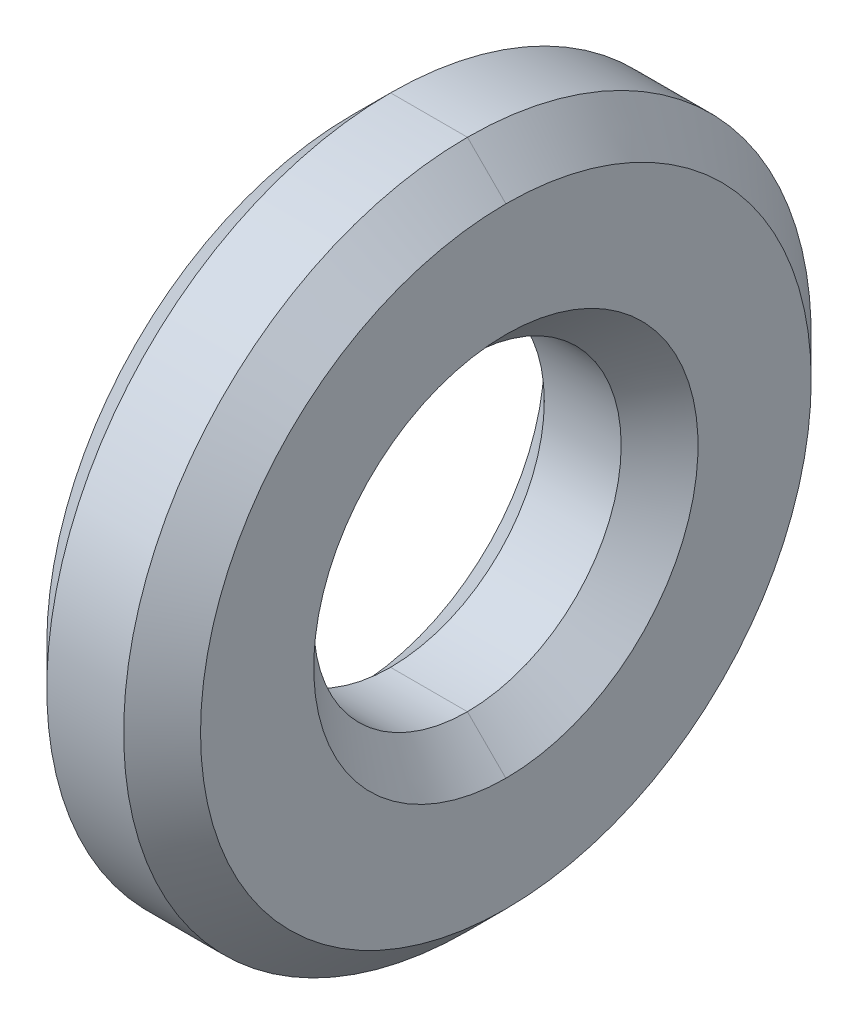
ISO-10303-21;
HEADER;
FILE_DESCRIPTION(('STEP AP214'),'2;1');
FILE_NAME('part.step','',(''),(''),'','','');
FILE_SCHEMA(('AUTOMOTIVE_DESIGN { 1 0 10303 214 1 1 1 1 }'));
ENDSEC;
DATA;
#1=APPLICATION_CONTEXT('core data for automotive mechanical design processes');
#2=APPLICATION_PROTOCOL_DEFINITION('international standard','automotive_design',2000,#1);
#3=PRODUCT_CONTEXT('',#1,'mechanical');
#4=PRODUCT('Part','Part','',(#3));
#5=PRODUCT_RELATED_PRODUCT_CATEGORY('part','',(#4));
#6=PRODUCT_DEFINITION_FORMATION('','',#4);
#7=PRODUCT_DEFINITION_CONTEXT('part definition',#1,'design');
#8=PRODUCT_DEFINITION('design','',#6,#7);
#9=PRODUCT_DEFINITION_SHAPE('','',#8);
#10=(LENGTH_UNIT() NAMED_UNIT(*) SI_UNIT(.MILLI.,.METRE.));
#11=(NAMED_UNIT(*) PLANE_ANGLE_UNIT() SI_UNIT($,.RADIAN.));
#12=(NAMED_UNIT(*) SI_UNIT($,.STERADIAN.) SOLID_ANGLE_UNIT());
#13=UNCERTAINTY_MEASURE_WITH_UNIT(LENGTH_MEASURE(1.E-05),#10,'distance_accuracy_value','');
#14=(GEOMETRIC_REPRESENTATION_CONTEXT(3) GLOBAL_UNCERTAINTY_ASSIGNED_CONTEXT((#13)) GLOBAL_UNIT_ASSIGNED_CONTEXT((#10,
#11,#12)) REPRESENTATION_CONTEXT('',''));
#15=CARTESIAN_POINT('',(0.,0.,0.));
#16=DIRECTION('',(0.,0.,1.));
#17=DIRECTION('',(1.,0.,0.));
#18=AXIS2_PLACEMENT_3D('',#15,#16,#17);
#19=CARTESIAN_POINT('',(2.9860679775,0.,0.));
#20=DIRECTION('',(-1.,0.,0.));
#21=DIRECTION('',(0.,-0.50000000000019,-0.866025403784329));
#22=AXIS2_PLACEMENT_3D('',#19,#20,#21);
#23=CONICAL_SURFACE('',#22,0.999999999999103,0.785398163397);
#24=DIRECTION('',(0.707106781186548,0.707106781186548,0.));
#25=VECTOR('',#24,1.);
#26=CARTESIAN_POINT('',(1.875,-2.1110679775,0.));
#27=LINE('',#26,#25);
#28=CARTESIAN_POINT('',(1.75,-2.2360679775,0.));
#29=VERTEX_POINT('',#28);
#30=CARTESIAN_POINT('',(2.,-1.9860679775,0.));
#31=VERTEX_POINT('',#30);
#32=EDGE_CURVE('E11',#29,#31,#27,.T.);
#33=ORIENTED_EDGE('',*,*,#32,.T.);
#34=CARTESIAN_POINT('',(2.,0.,0.));
#35=DIRECTION('',(-1.,0.,0.));
#36=DIRECTION('',(0.,-1.,0.));
#37=AXIS2_PLACEMENT_3D('',#34,#35,#36);
#38=CIRCLE('',#37,1.9860679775);
#39=CARTESIAN_POINT('',(2.,1.9860679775,0.));
#40=VERTEX_POINT('',#39);
#41=EDGE_CURVE('E154',#31,#40,#38,.T.);
#42=ORIENTED_EDGE('',*,*,#41,.T.);
#43=DIRECTION('',(0.707106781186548,-0.707106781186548,0.));
#44=VECTOR('',#43,1.);
#45=CARTESIAN_POINT('',(1.875,2.1110679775,0.));
#46=LINE('',#45,#44);
#47=CARTESIAN_POINT('',(1.75,2.2360679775,0.));
#48=VERTEX_POINT('',#47);
#49=EDGE_CURVE('E27',#48,#40,#46,.T.);
#50=ORIENTED_EDGE('',*,*,#49,.F.);
#51=CARTESIAN_POINT('',(1.75,0.,0.));
#52=DIRECTION('',(-1.,0.,0.));
#53=DIRECTION('',(0.,1.,0.));
#54=AXIS2_PLACEMENT_3D('',#51,#52,#53);
#55=CIRCLE('',#54,2.2360679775);
#56=EDGE_CURVE('E176',#29,#48,#55,.T.);
#57=ORIENTED_EDGE('',*,*,#56,.F.);
#58=EDGE_LOOP('',(#33,#42,#50,#57));
#59=FACE_BOUND('',#58,.T.);
#60=ADVANCED_FACE('F16',(#59),#23,.T.);
#61=CARTESIAN_POINT('',(2.9860679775,0.,0.));
#62=DIRECTION('',(-1.,0.,0.));
#63=DIRECTION('',(0.,1.,0.));
#64=AXIS2_PLACEMENT_3D('',#61,#62,#63);
#65=CONICAL_SURFACE('',#64,0.999999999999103,0.785398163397);
#66=ORIENTED_EDGE('',*,*,#49,.T.);
#67=CARTESIAN_POINT('',(2.,0.,0.));
#68=DIRECTION('',(-1.,0.,0.));
#69=DIRECTION('',(0.,-1.,0.));
#70=AXIS2_PLACEMENT_3D('',#67,#68,#69);
#71=CIRCLE('',#70,1.9860679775);
#72=EDGE_CURVE('E157',#40,#31,#71,.T.);
#73=ORIENTED_EDGE('',*,*,#72,.T.);
#74=ORIENTED_EDGE('',*,*,#32,.F.);
#75=CARTESIAN_POINT('',(1.75,0.,0.));
#76=DIRECTION('',(-1.,0.,0.));
#77=DIRECTION('',(0.,1.,0.));
#78=AXIS2_PLACEMENT_3D('',#75,#76,#77);
#79=CIRCLE('',#78,2.2360679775);
#80=EDGE_CURVE('E179',#48,#29,#79,.T.);
#81=ORIENTED_EDGE('',*,*,#80,.F.);
#82=EDGE_LOOP('',(#66,#73,#74,#81));
#83=FACE_BOUND('',#82,.T.);
#84=ADVANCED_FACE('F231',(#83),#65,.T.);
#85=CARTESIAN_POINT('',(2.11000000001,0.,0.));
#86=DIRECTION('',(1.,0.,0.));
#87=DIRECTION('',(0.,1.,0.));
#88=AXIS2_PLACEMENT_3D('',#85,#86,#87);
#89=CYLINDRICAL_SURFACE('',#88,2.2360679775);
#90=DIRECTION('',(1.,0.,0.));
#91=VECTOR('',#90,1.);
#92=CARTESIAN_POINT('',(2.11000000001,2.2360679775,0.));
#93=LINE('',#92,#91);
#94=CARTESIAN_POINT('',(1.25,2.2360679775,0.));
#95=VERTEX_POINT('',#94);
#96=EDGE_CURVE('E117',#95,#48,#93,.T.);
#97=ORIENTED_EDGE('',*,*,#96,.F.);
#98=CARTESIAN_POINT('',(1.25,0.,0.));
#99=DIRECTION('',(1.,0.,0.));
#100=DIRECTION('',(0.,1.,0.));
#101=AXIS2_PLACEMENT_3D('',#98,#99,#100);
#102=CIRCLE('',#101,2.2360679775);
#103=CARTESIAN_POINT('',(1.25,-2.2360679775,0.));
#104=VERTEX_POINT('',#103);
#105=EDGE_CURVE('E158',#95,#104,#102,.T.);
#106=ORIENTED_EDGE('',*,*,#105,.T.);
#107=DIRECTION('',(1.,0.,0.));
#108=VECTOR('',#107,1.);
#109=CARTESIAN_POINT('',(2.11000000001,-2.2360679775,0.));
#110=LINE('',#109,#108);
#111=EDGE_CURVE('E165',#104,#29,#110,.T.);
#112=ORIENTED_EDGE('',*,*,#111,.T.);
#113=ORIENTED_EDGE('',*,*,#56,.T.);
#114=EDGE_LOOP('',(#97,#106,#112,#113));
#115=FACE_BOUND('',#114,.T.);
#116=ADVANCED_FACE('F18',(#115),#89,.T.);
#117=CARTESIAN_POINT('',(2.11000000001,0.,0.));
#118=DIRECTION('',(1.,0.,0.));
#119=DIRECTION('',(0.,1.,0.));
#120=AXIS2_PLACEMENT_3D('',#117,#118,#119);
#121=CYLINDRICAL_SURFACE('',#120,2.2360679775);
#122=ORIENTED_EDGE('',*,*,#111,.F.);
#123=CARTESIAN_POINT('',(1.25,0.,0.));
#124=DIRECTION('',(1.,0.,0.));
#125=DIRECTION('',(0.,1.,0.));
#126=AXIS2_PLACEMENT_3D('',#123,#124,#125);
#127=CIRCLE('',#126,2.2360679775);
#128=EDGE_CURVE('E163',#104,#95,#127,.T.);
#129=ORIENTED_EDGE('',*,*,#128,.T.);
#130=ORIENTED_EDGE('',*,*,#96,.T.);
#131=ORIENTED_EDGE('',*,*,#80,.T.);
#132=EDGE_LOOP('',(#122,#129,#130,#131));
#133=FACE_BOUND('',#132,.T.);
#134=ADVANCED_FACE('F254',(#133),#121,.T.);
#135=CARTESIAN_POINT('',(2.,-10.,-11.5));
#136=DIRECTION('',(-1.,0.,0.));
#137=DIRECTION('',(0.,1.,0.));
#138=AXIS2_PLACEMENT_3D('',#135,#136,#137);
#139=PLANE('',#138);
#140=CARTESIAN_POINT('',(2.,0.,0.));
#141=DIRECTION('',(-1.,0.,0.));
#142=DIRECTION('',(0.,-1.,0.));
#143=AXIS2_PLACEMENT_3D('',#140,#141,#142);
#144=CIRCLE('',#143,1.25);
#145=CARTESIAN_POINT('',(2.,-1.25,0.));
#146=VERTEX_POINT('',#145);
#147=CARTESIAN_POINT('',(2.,1.25,0.));
#148=VERTEX_POINT('',#147);
#149=EDGE_CURVE('E87',#146,#148,#144,.T.);
#150=ORIENTED_EDGE('',*,*,#149,.T.);
#151=CARTESIAN_POINT('',(2.,0.,0.));
#152=DIRECTION('',(-1.,0.,0.));
#153=DIRECTION('',(0.,-1.,0.));
#154=AXIS2_PLACEMENT_3D('',#151,#152,#153);
#155=CIRCLE('',#154,1.25);
#156=EDGE_CURVE('E83',#148,#146,#155,.T.);
#157=ORIENTED_EDGE('',*,*,#156,.T.);
#158=EDGE_LOOP('',(#150,#157));
#159=FACE_BOUND('',#158,.T.);
#160=ORIENTED_EDGE('',*,*,#41,.F.);
#161=ORIENTED_EDGE('',*,*,#72,.F.);
#162=EDGE_LOOP('',(#160,#161));
#163=FACE_BOUND('',#162,.T.);
#164=ADVANCED_FACE('F85',(#159,#163),#139,.F.);
#165=CARTESIAN_POINT('',(0.0139320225,0.,0.));
#166=DIRECTION('',(1.,0.,0.));
#167=DIRECTION('',(0.,1.,0.));
#168=AXIS2_PLACEMENT_3D('',#165,#166,#167);
#169=CONICAL_SURFACE('',#168,0.999999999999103,0.785398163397);
#170=DIRECTION('',(-0.707106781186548,-0.707106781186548,0.));
#171=VECTOR('',#170,1.);
#172=CARTESIAN_POINT('',(1.125,2.1110679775,0.));
#173=LINE('',#172,#171);
#174=CARTESIAN_POINT('',(1.,1.9860679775,0.));
#175=VERTEX_POINT('',#174);
#176=EDGE_CURVE('E122',#95,#175,#173,.T.);
#177=ORIENTED_EDGE('',*,*,#176,.T.);
#178=CARTESIAN_POINT('',(1.,0.,0.));
#179=DIRECTION('',(1.,0.,0.));
#180=DIRECTION('',(0.,1.,0.));
#181=AXIS2_PLACEMENT_3D('',#178,#179,#180);
#182=CIRCLE('',#181,1.9860679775);
#183=CARTESIAN_POINT('',(1.,-1.9860679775,0.));
#184=VERTEX_POINT('',#183);
#185=EDGE_CURVE('E92',#175,#184,#182,.T.);
#186=ORIENTED_EDGE('',*,*,#185,.T.);
#187=DIRECTION('',(-0.707106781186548,0.707106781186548,0.));
#188=VECTOR('',#187,1.);
#189=CARTESIAN_POINT('',(1.125,-2.1110679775,0.));
#190=LINE('',#189,#188);
#191=EDGE_CURVE('E119',#104,#184,#190,.T.);
#192=ORIENTED_EDGE('',*,*,#191,.F.);
#193=ORIENTED_EDGE('',*,*,#105,.F.);
#194=EDGE_LOOP('',(#177,#186,#192,#193));
#195=FACE_BOUND('',#194,.T.);
#196=ADVANCED_FACE('F213',(#195),#169,.T.);
#197=CARTESIAN_POINT('',(0.0139320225,0.,0.));
#198=DIRECTION('',(1.,0.,0.));
#199=DIRECTION('',(0.,-0.50000000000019,0.866025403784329));
#200=AXIS2_PLACEMENT_3D('',#197,#198,#199);
#201=CONICAL_SURFACE('',#200,0.999999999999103,0.785398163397);
#202=ORIENTED_EDGE('',*,*,#191,.T.);
#203=CARTESIAN_POINT('',(1.,0.,0.));
#204=DIRECTION('',(1.,0.,0.));
#205=DIRECTION('',(0.,1.,0.));
#206=AXIS2_PLACEMENT_3D('',#203,#204,#205);
#207=CIRCLE('',#206,1.9860679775);
#208=EDGE_CURVE('E123',#184,#175,#207,.T.);
#209=ORIENTED_EDGE('',*,*,#208,.T.);
#210=ORIENTED_EDGE('',*,*,#176,.F.);
#211=ORIENTED_EDGE('',*,*,#128,.F.);
#212=EDGE_LOOP('',(#202,#209,#210,#211));
#213=FACE_BOUND('',#212,.T.);
#214=ADVANCED_FACE('F210',(#213),#201,.T.);
#215=CARTESIAN_POINT('',(1.,0.,0.));
#216=DIRECTION('',(1.,0.,0.));
#217=DIRECTION('',(0.,1.,0.));
#218=AXIS2_PLACEMENT_3D('',#215,#216,#217);
#219=PLANE('',#218);
#220=CARTESIAN_POINT('',(1.,0.,0.));
#221=DIRECTION('',(1.,0.,0.));
#222=DIRECTION('',(0.,1.,0.));
#223=AXIS2_PLACEMENT_3D('',#220,#221,#222);
#224=CIRCLE('',#223,1.25);
#225=CARTESIAN_POINT('',(1.,1.25,0.));
#226=VERTEX_POINT('',#225);
#227=CARTESIAN_POINT('',(1.,-1.25,0.));
#228=VERTEX_POINT('',#227);
#229=EDGE_CURVE('E127',#226,#228,#224,.T.);
#230=ORIENTED_EDGE('',*,*,#229,.T.);
#231=CARTESIAN_POINT('',(1.,0.,0.));
#232=DIRECTION('',(1.,0.,0.));
#233=DIRECTION('',(0.,1.,0.));
#234=AXIS2_PLACEMENT_3D('',#231,#232,#233);
#235=CIRCLE('',#234,1.25);
#236=EDGE_CURVE('E161',#228,#226,#235,.T.);
#237=ORIENTED_EDGE('',*,*,#236,.T.);
#238=EDGE_LOOP('',(#230,#237));
#239=FACE_BOUND('',#238,.T.);
#240=ORIENTED_EDGE('',*,*,#185,.F.);
#241=ORIENTED_EDGE('',*,*,#208,.F.);
#242=EDGE_LOOP('',(#240,#241));
#243=FACE_BOUND('',#242,.T.);
#244=ADVANCED_FACE('F218',(#239,#243),#219,.F.);
#245=CARTESIAN_POINT('',(1.75,0.,0.));
#246=DIRECTION('',(1.,0.,0.));
#247=DIRECTION('',(0.,1.,0.));
#248=AXIS2_PLACEMENT_3D('',#245,#246,#247);
#249=CONICAL_SURFACE('',#248,0.999999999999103,0.785398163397);
#250=DIRECTION('',(-0.707106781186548,-0.707106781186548,0.));
#251=VECTOR('',#250,1.);
#252=CARTESIAN_POINT('',(1.875,1.125,0.));
#253=LINE('',#252,#251);
#254=CARTESIAN_POINT('',(1.75,1.,0.));
#255=VERTEX_POINT('',#254);
#256=EDGE_CURVE('E20',#148,#255,#253,.T.);
#257=ORIENTED_EDGE('',*,*,#256,.T.);
#258=CARTESIAN_POINT('',(1.75,0.,0.));
#259=DIRECTION('',(-1.,0.,0.));
#260=DIRECTION('',(0.,1.,0.));
#261=AXIS2_PLACEMENT_3D('',#258,#259,#260);
#262=CIRCLE('',#261,1.);
#263=CARTESIAN_POINT('',(1.75,-1.,0.));
#264=VERTEX_POINT('',#263);
#265=EDGE_CURVE('E104',#255,#264,#262,.T.);
#266=ORIENTED_EDGE('',*,*,#265,.T.);
#267=DIRECTION('',(-0.707106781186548,0.707106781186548,0.));
#268=VECTOR('',#267,1.);
#269=CARTESIAN_POINT('',(1.875,-1.125,0.));
#270=LINE('',#269,#268);
#271=EDGE_CURVE('E97',#146,#264,#270,.T.);
#272=ORIENTED_EDGE('',*,*,#271,.F.);
#273=ORIENTED_EDGE('',*,*,#156,.F.);
#274=EDGE_LOOP('',(#257,#266,#272,#273));
#275=FACE_BOUND('',#274,.T.);
#276=ADVANCED_FACE('F102',(#275),#249,.F.);
#277=CARTESIAN_POINT('',(1.75,0.,0.));
#278=DIRECTION('',(1.,0.,0.));
#279=DIRECTION('',(0.,-0.50000000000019,-0.866025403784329));
#280=AXIS2_PLACEMENT_3D('',#277,#278,#279);
#281=CONICAL_SURFACE('',#280,0.999999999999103,0.785398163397);
#282=ORIENTED_EDGE('',*,*,#271,.T.);
#283=CARTESIAN_POINT('',(1.75,0.,0.));
#284=DIRECTION('',(-1.,0.,0.));
#285=DIRECTION('',(0.,1.,0.));
#286=AXIS2_PLACEMENT_3D('',#283,#284,#285);
#287=CIRCLE('',#286,1.);
#288=EDGE_CURVE('E106',#264,#255,#287,.T.);
#289=ORIENTED_EDGE('',*,*,#288,.T.);
#290=ORIENTED_EDGE('',*,*,#256,.F.);
#291=ORIENTED_EDGE('',*,*,#149,.F.);
#292=EDGE_LOOP('',(#282,#289,#290,#291));
#293=FACE_BOUND('',#292,.T.);
#294=ADVANCED_FACE('F95',(#293),#281,.F.);
#295=CARTESIAN_POINT('',(2.11000000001,0.,0.));
#296=DIRECTION('',(1.,0.,0.));
#297=DIRECTION('',(0.,1.,0.));
#298=AXIS2_PLACEMENT_3D('',#295,#296,#297);
#299=CYLINDRICAL_SURFACE('',#298,1.);
#300=ORIENTED_EDGE('',*,*,#288,.F.);
#301=DIRECTION('',(1.,0.,0.));
#302=VECTOR('',#301,1.);
#303=CARTESIAN_POINT('',(2.11000000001,-1.,0.));
#304=LINE('',#303,#302);
#305=CARTESIAN_POINT('',(1.25,-1.,0.));
#306=VERTEX_POINT('',#305);
#307=EDGE_CURVE('E113',#306,#264,#304,.T.);
#308=ORIENTED_EDGE('',*,*,#307,.F.);
#309=CARTESIAN_POINT('',(1.25,0.,0.));
#310=DIRECTION('',(1.,0.,0.));
#311=DIRECTION('',(0.,1.,0.));
#312=AXIS2_PLACEMENT_3D('',#309,#310,#311);
#313=CIRCLE('',#312,1.);
#314=CARTESIAN_POINT('',(1.25,1.,0.));
#315=VERTEX_POINT('',#314);
#316=EDGE_CURVE('E128',#315,#306,#313,.T.);
#317=ORIENTED_EDGE('',*,*,#316,.F.);
#318=DIRECTION('',(1.,0.,0.));
#319=VECTOR('',#318,1.);
#320=CARTESIAN_POINT('',(2.11000000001,1.,0.));
#321=LINE('',#320,#319);
#322=EDGE_CURVE('E172',#315,#255,#321,.T.);
#323=ORIENTED_EDGE('',*,*,#322,.T.);
#324=EDGE_LOOP('',(#300,#308,#317,#323));
#325=FACE_BOUND('',#324,.T.);
#326=ADVANCED_FACE('F241',(#325),#299,.F.);
#327=CARTESIAN_POINT('',(2.11000000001,0.,0.));
#328=DIRECTION('',(1.,0.,0.));
#329=DIRECTION('',(0.,1.,0.));
#330=AXIS2_PLACEMENT_3D('',#327,#328,#329);
#331=CYLINDRICAL_SURFACE('',#330,1.);
#332=ORIENTED_EDGE('',*,*,#265,.F.);
#333=ORIENTED_EDGE('',*,*,#322,.F.);
#334=CARTESIAN_POINT('',(1.25,0.,0.));
#335=DIRECTION('',(1.,0.,0.));
#336=DIRECTION('',(0.,1.,0.));
#337=AXIS2_PLACEMENT_3D('',#334,#335,#336);
#338=CIRCLE('',#337,1.);
#339=EDGE_CURVE('E139',#306,#315,#338,.T.);
#340=ORIENTED_EDGE('',*,*,#339,.F.);
#341=ORIENTED_EDGE('',*,*,#307,.T.);
#342=EDGE_LOOP('',(#332,#333,#340,#341));
#343=FACE_BOUND('',#342,.T.);
#344=ADVANCED_FACE('F250',(#343),#331,.F.);
#345=CARTESIAN_POINT('',(1.25,0.,0.));
#346=DIRECTION('',(-1.,0.,0.));
#347=DIRECTION('',(0.,-0.50000000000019,0.866025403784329));
#348=AXIS2_PLACEMENT_3D('',#345,#346,#347);
#349=CONICAL_SURFACE('',#348,0.999999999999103,0.785398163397);
#350=DIRECTION('',(0.707106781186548,0.707106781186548,0.));
#351=VECTOR('',#350,1.);
#352=CARTESIAN_POINT('',(1.125,-1.125,0.));
#353=LINE('',#352,#351);
#354=EDGE_CURVE('E124',#228,#306,#353,.T.);
#355=ORIENTED_EDGE('',*,*,#354,.T.);
#356=ORIENTED_EDGE('',*,*,#339,.T.);
#357=DIRECTION('',(0.707106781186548,-0.707106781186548,0.));
#358=VECTOR('',#357,1.);
#359=CARTESIAN_POINT('',(1.125,1.125,0.));
#360=LINE('',#359,#358);
#361=EDGE_CURVE('E141',#226,#315,#360,.T.);
#362=ORIENTED_EDGE('',*,*,#361,.F.);
#363=ORIENTED_EDGE('',*,*,#236,.F.);
#364=EDGE_LOOP('',(#355,#356,#362,#363));
#365=FACE_BOUND('',#364,.T.);
#366=ADVANCED_FACE('F245',(#365),#349,.F.);
#367=CARTESIAN_POINT('',(1.25,0.,0.));
#368=DIRECTION('',(-1.,0.,0.));
#369=DIRECTION('',(0.,1.,0.));
#370=AXIS2_PLACEMENT_3D('',#367,#368,#369);
#371=CONICAL_SURFACE('',#370,0.999999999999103,0.785398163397);
#372=ORIENTED_EDGE('',*,*,#361,.T.);
#373=ORIENTED_EDGE('',*,*,#316,.T.);
#374=ORIENTED_EDGE('',*,*,#354,.F.);
#375=ORIENTED_EDGE('',*,*,#229,.F.);
#376=EDGE_LOOP('',(#372,#373,#374,#375));
#377=FACE_BOUND('',#376,.T.);
#378=ADVANCED_FACE('F242',(#377),#371,.F.);
#379=CLOSED_SHELL('',(#60,#84,#116,#134,#164,#196,#214,#244,#276,#294,#326,#344,#366,#378));
#380=MANIFOLD_SOLID_BREP('B1',#379);
#381=ADVANCED_BREP_SHAPE_REPRESENTATION('',(#18,#380),#14);
#382=SHAPE_DEFINITION_REPRESENTATION(#9,#381);
ENDSEC;
END-ISO-10303-21;
